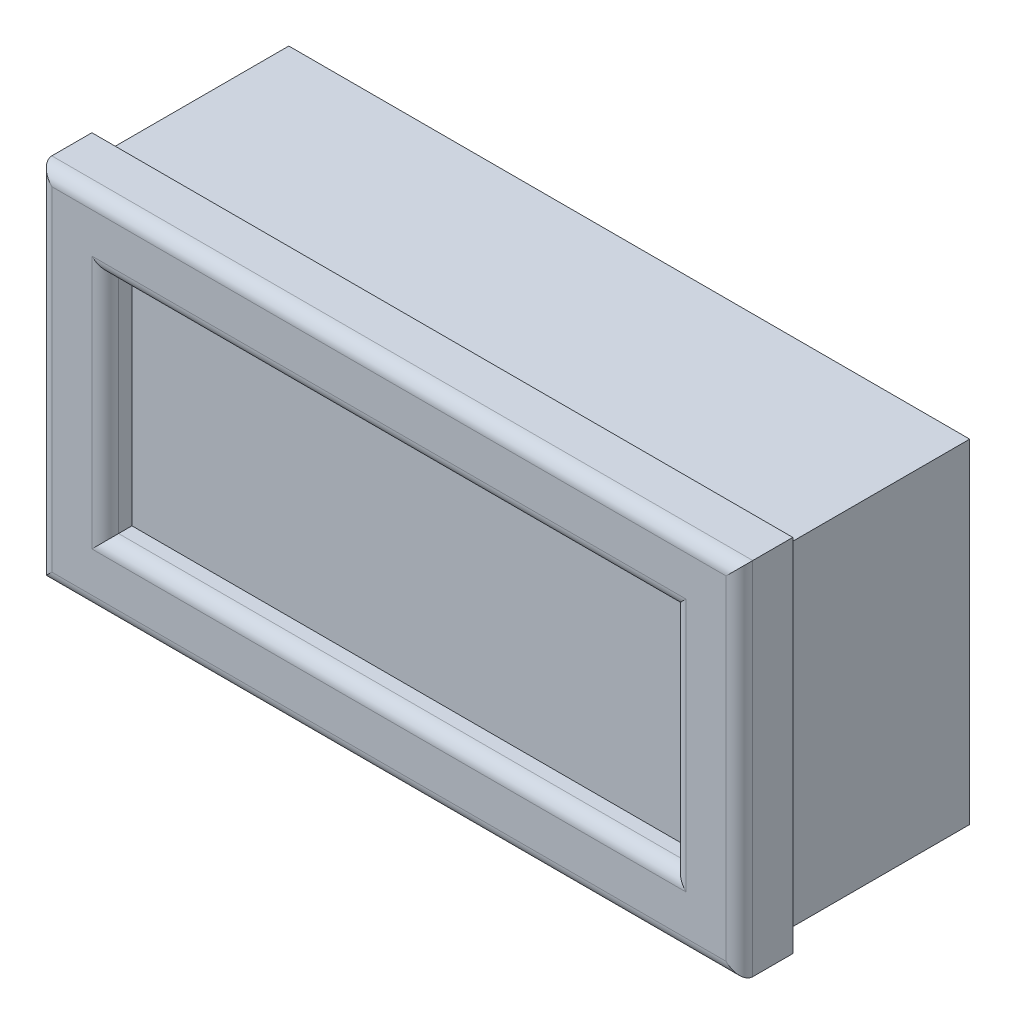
from build123d import *

# Parameters (mm, degrees)
ESQUISSE1_W             = 52.5
ESQUISSE1_H             = 27
BOSS_EXTRU_1_DEPTH      = 4
ESQUISSE2_W             = 42.5
ESQUISSE2_H             = 17
ENL_V_MAT_EXTRU_1_DEPTH = 2
ESQUISSE3_W             = 51
ESQUISSE3_H             = 25
BOSS_EXTRU_2_DEPTH      = 14
CONG_1_R                = 1
ESQUISSE4_R             = 1.5
BOSS_EXTRU_3_DEPTH      = 1.5


with BuildPart() as part:
    # Esquisse1 → Boss.-Extru.1 (new body)
    with BuildSketch(Plane.XY):
        with Locations((3.038422, -1.904042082)):
            Rectangle(ESQUISSE1_W, ESQUISSE1_H)
    extrude(amount=BOSS_EXTRU_1_DEPTH)

    # Esquisse2 → Enl_v. mat.-Extru.1 (cut)
    with BuildSketch(Plane.XY.offset(4)):
        with Locations((3.038422, -1.904042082)):
            Rectangle(ESQUISSE2_W, ESQUISSE2_H)
    extrude(amount=-ENL_V_MAT_EXTRU_1_DEPTH, mode=Mode.SUBTRACT)

    # Esquisse3 → Boss.-Extru.2 (add)
    with BuildSketch(Plane(origin=(0, 0, 0), x_dir=(-1, 0, 0), z_dir=(0, 0, -1))):
        with Locations((-3.038422, -1.904042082)):
            Rectangle(ESQUISSE3_W, ESQUISSE3_H)
    extrude(amount=BOSS_EXTRU_2_DEPTH)

    # Cong_1
    cong_1_edges = [part.edges().sort_by_distance(p)[0] for p in [
        (29.288422, -1.904042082, 4),
        (3.038422, 11.595957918, 4),
        (-18.211578, -1.904042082, 4),
        (3.038422, -10.404042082, 4),
        (24.288422, -1.904042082, 4),
        (3.038422, 6.595957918, 4),
        (-23.211578, -1.904042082, 4),
        (3.038422, -15.404042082, 4),
    ]]
    fillet(cong_1_edges, radius=CONG_1_R)

    # Esquisse4 → Boss.-Extru.3 (add)
    with BuildSketch(Plane(origin=(0, 0, -14), x_dir=(-1, 0, 0), z_dir=(0, 0, -1))):
        with Locations((5.461578, 4.595957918)):
            Circle(ESQUISSE4_R)
        with Locations((12.461578, 4.595957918)):
            Circle(ESQUISSE4_R)
    extrude(amount=BOSS_EXTRU_3_DEPTH)


solid = part.part
